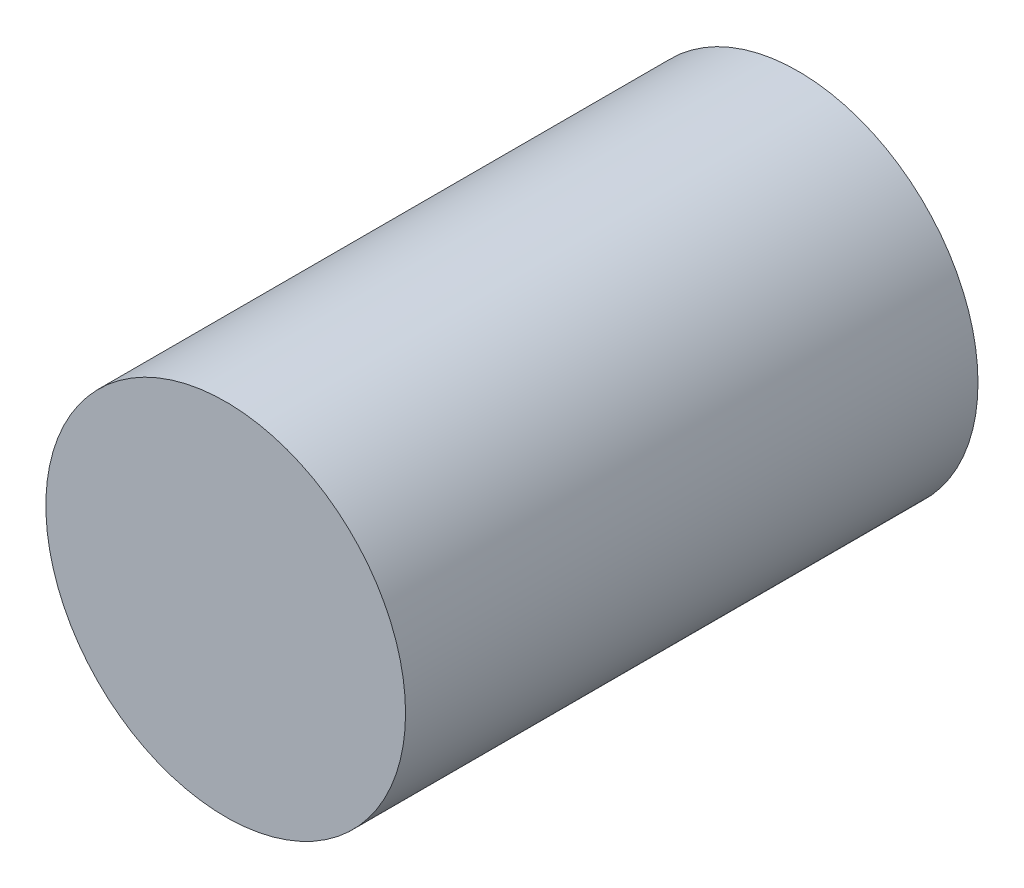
ISO-10303-21;
HEADER;
FILE_DESCRIPTION(('STEP AP214'),'2;1');
FILE_NAME('part.step','',(''),(''),'','','');
FILE_SCHEMA(('AUTOMOTIVE_DESIGN { 1 0 10303 214 1 1 1 1 }'));
ENDSEC;
DATA;
#1=APPLICATION_CONTEXT('core data for automotive mechanical design processes');
#2=APPLICATION_PROTOCOL_DEFINITION('international standard','automotive_design',2000,#1);
#3=PRODUCT_CONTEXT('',#1,'mechanical');
#4=PRODUCT('Part','Part','',(#3));
#5=PRODUCT_RELATED_PRODUCT_CATEGORY('part','',(#4));
#6=PRODUCT_DEFINITION_FORMATION('','',#4);
#7=PRODUCT_DEFINITION_CONTEXT('part definition',#1,'design');
#8=PRODUCT_DEFINITION('design','',#6,#7);
#9=PRODUCT_DEFINITION_SHAPE('','',#8);
#10=(LENGTH_UNIT() NAMED_UNIT(*) SI_UNIT(.MILLI.,.METRE.));
#11=(NAMED_UNIT(*) PLANE_ANGLE_UNIT() SI_UNIT($,.RADIAN.));
#12=(NAMED_UNIT(*) SI_UNIT($,.STERADIAN.) SOLID_ANGLE_UNIT());
#13=UNCERTAINTY_MEASURE_WITH_UNIT(LENGTH_MEASURE(1.E-05),#10,'distance_accuracy_value','');
#14=(GEOMETRIC_REPRESENTATION_CONTEXT(3) GLOBAL_UNCERTAINTY_ASSIGNED_CONTEXT((#13)) GLOBAL_UNIT_ASSIGNED_CONTEXT((#10,
#11,#12)) REPRESENTATION_CONTEXT('',''));
#15=CARTESIAN_POINT('',(0.,0.,0.));
#16=DIRECTION('',(0.,0.,1.));
#17=DIRECTION('',(1.,0.,0.));
#18=AXIS2_PLACEMENT_3D('',#15,#16,#17);
#19=CARTESIAN_POINT('',(0.,-1.397,85.2932));
#20=DIRECTION('',(0.,0.,-1.));
#21=DIRECTION('',(-1.,0.,0.));
#22=AXIS2_PLACEMENT_3D('',#19,#20,#21);
#23=PLANE('',#22);
#24=CARTESIAN_POINT('',(0.,-1.397,85.2932));
#25=DIRECTION('',(0.,0.,1.));
#26=DIRECTION('',(1.,0.,0.));
#27=AXIS2_PLACEMENT_3D('',#24,#25,#26);
#28=CIRCLE('',#27,26.797);
#29=CARTESIAN_POINT('',(26.797,-1.397,85.2932));
#30=VERTEX_POINT('',#29);
#31=EDGE_CURVE('E17',#30,#30,#28,.F.);
#32=ORIENTED_EDGE('',*,*,#31,.F.);
#33=EDGE_LOOP('',(#32));
#34=FACE_BOUND('',#33,.T.);
#35=ADVANCED_FACE('F14',(#34),#23,.F.);
#36=CARTESIAN_POINT('',(0.,-1.397,0.));
#37=DIRECTION('',(0.,0.,-1.));
#38=DIRECTION('',(-1.,0.,0.));
#39=AXIS2_PLACEMENT_3D('',#36,#37,#38);
#40=PLANE('',#39);
#41=CARTESIAN_POINT('',(0.,-1.397,0.));
#42=DIRECTION('',(0.,0.,1.));
#43=DIRECTION('',(1.,0.,0.));
#44=AXIS2_PLACEMENT_3D('',#41,#42,#43);
#45=CIRCLE('',#44,26.797);
#46=CARTESIAN_POINT('',(26.797,-1.397,0.));
#47=VERTEX_POINT('',#46);
#48=EDGE_CURVE('E10',#47,#47,#45,.T.);
#49=ORIENTED_EDGE('',*,*,#48,.F.);
#50=EDGE_LOOP('',(#49));
#51=FACE_BOUND('',#50,.T.);
#52=ADVANCED_FACE('F29',(#51),#40,.T.);
#53=CARTESIAN_POINT('',(0.,-1.397,0.));
#54=DIRECTION('',(0.,0.,1.));
#55=DIRECTION('',(1.,0.,0.));
#56=AXIS2_PLACEMENT_3D('',#53,#54,#55);
#57=CYLINDRICAL_SURFACE('',#56,26.797);
#58=ORIENTED_EDGE('',*,*,#48,.T.);
#59=EDGE_LOOP('',(#58));
#60=FACE_BOUND('',#59,.T.);
#61=ORIENTED_EDGE('',*,*,#31,.T.);
#62=EDGE_LOOP('',(#61));
#63=FACE_BOUND('',#62,.T.);
#64=ADVANCED_FACE('F26',(#60,#63),#57,.T.);
#65=CLOSED_SHELL('',(#35,#52,#64));
#66=MANIFOLD_SOLID_BREP('B1',#65);
#67=ADVANCED_BREP_SHAPE_REPRESENTATION('',(#18,#66),#14);
#68=SHAPE_DEFINITION_REPRESENTATION(#9,#67);
ENDSEC;
END-ISO-10303-21;
